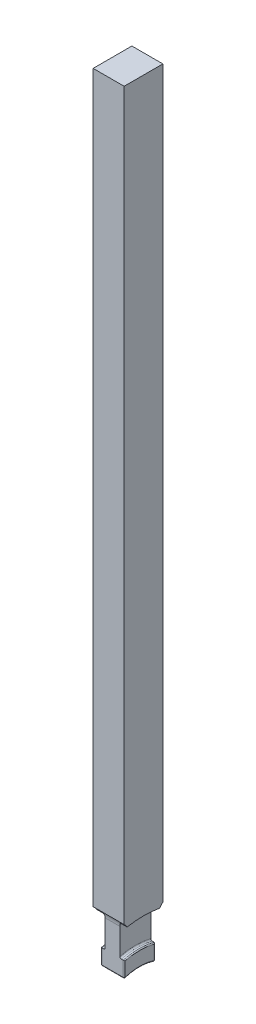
from build123d import *

# Parameters (mm, degrees)
SKETCH1_W               = 10
SKETCH1_H               = 212
BOSS_EXTRUDE1_DEPTH     = 4
CUT_EXTRUDE4_DEPTH      = 213.09667607
CUT_EXTRUDE4_DEPTH_BACK = 213.09667607
SKETCH8_R               = 12
SKETCH2_W               = 2.095
SKETCH2_H               = 8
CUT_EXTRUDE2_DEPTH      = 213.09667607
CUT_EXTRUDE2_DEPTH_BACK = 213.09667607
CUT_EXTRUDE3_DEPTH      = 213.09667607
CUT_EXTRUDE3_DEPTH_BACK = 213.09667607
SKETCH7_W               = 1
SKETCH7_H               = 16
FILLET1_R               = 0.762
FILLET2_R               = 0.381
FILLET3_R               = 0.254


with BuildPart() as part:
    # Sketch1 → Boss-Extrude1 (new, symmetric)
    with BuildSketch(Plane(origin=(0, 0, 0), x_dir=(0, 0, -1), z_dir=(1, 0, 0))):
        with Locations((0, 106)):
            Rectangle(SKETCH1_W, SKETCH1_H)
    extrude(amount=BOSS_EXTRUDE1_DEPTH, both=True)

    # Sketch8 → Cut-Extrude4 (cut, two sides: drawn at the far end of the back side and taken through both)
    with BuildSketch(Plane(origin=(0, 0, 0), x_dir=(0, 0, -1), z_dir=(1, 0, 0)).offset(-CUT_EXTRUDE4_DEPTH_BACK)):
        Circle(SKETCH8_R)
    extrude(amount=CUT_EXTRUDE4_DEPTH + CUT_EXTRUDE4_DEPTH_BACK, mode=Mode.SUBTRACT)

    # Sketch2 → Cut-Revolve1 (revolve, cut)
    with BuildSketch(Plane.XY):
        with Locations((2.9525, 20)):
            Rectangle(SKETCH2_W, SKETCH2_H)
        with Locations((-2.9525, 20)):
            Rectangle(SKETCH2_W, SKETCH2_H)
    revolve(axis=Axis((-8.84822894, 0, 0), (1, 0, 0)), mode=Mode.SUBTRACT)

    # Sketch6 → Cut-Extrude2 (cut, two sides: drawn at the far end of the back side and taken through both)
    with BuildSketch(Plane(origin=(0, 0, 0), x_dir=(0, 0, -1), z_dir=(1, 0, 0)).offset(-CUT_EXTRUDE2_DEPTH_BACK)):
        with BuildLine():
            Line((4, 0), (23.05, 0))
            Line((23.05, 0), (23.05, 25))
            Line((23.05, 25), (6.3876, 25))
            ThreePointArc((6.3876, 25), (4.699311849, 24.300688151), (4, 22.6124))
            Line((4, 22.6124), (4, 0))
        make_face()
        with BuildLine():
            Line((-4, 0), (-23.05, 0))
            Line((-23.05, 0), (-23.05, 25))
            Line((-23.05, 25), (-6.3876, 25))
            ThreePointArc((-6.3876, 25), (-4.699311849, 24.300688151), (-4, 22.6124))
            Line((-4, 22.6124), (-4, 0))
        make_face()
    extrude(amount=CUT_EXTRUDE2_DEPTH + CUT_EXTRUDE2_DEPTH_BACK, mode=Mode.SUBTRACT)

    # Sketch7 → Cut-Extrude3 (cut, two sides: drawn at the far end of the back side and taken through both)
    with BuildSketch(Plane.XY.offset(-CUT_EXTRUDE3_DEPTH_BACK)):
        with Locations((-3.5, 8)):
            Rectangle(SKETCH7_W, SKETCH7_H)
        with Locations((3.5, 8)):
            Rectangle(SKETCH7_W, SKETCH7_H)
    extrude(amount=CUT_EXTRUDE3_DEPTH + CUT_EXTRUDE3_DEPTH_BACK, mode=Mode.SUBTRACT)

    # Fillet1
    fillet1_edges = [part.edges().sort_by_distance(p)[0] for p in [
        (1.905, 24, 0),
        (-1.905, 24, 0),
    ]]
    fillet(fillet1_edges, radius=FILLET1_R)

    # Fillet2
    fillet2_edges = [part.edges().sort_by_distance(p)[0] for p in [
        (1.905, 16, 0),
        (-1.905, 16, 0),
    ]]
    fillet(fillet2_edges, radius=FILLET2_R)

    # Fillet3
    fillet3_edges = [part.edges().sort_by_distance(p)[0] for p in [
        (0, 11.313708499, -4),
        (3, 13.402820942, -4),
        (-3, 13.402820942, -4),
        (0, 11.313708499, 4),
        (-3, 16, 0),
        (-3, 13.402820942, 4),
        (-3, 12, 0),
        (3, 16, 0),
        (3, 12, 0),
        (3, 13.402820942, 4),
    ]]
    fillet(fillet3_edges, radius=FILLET3_R)


solid = part.part
